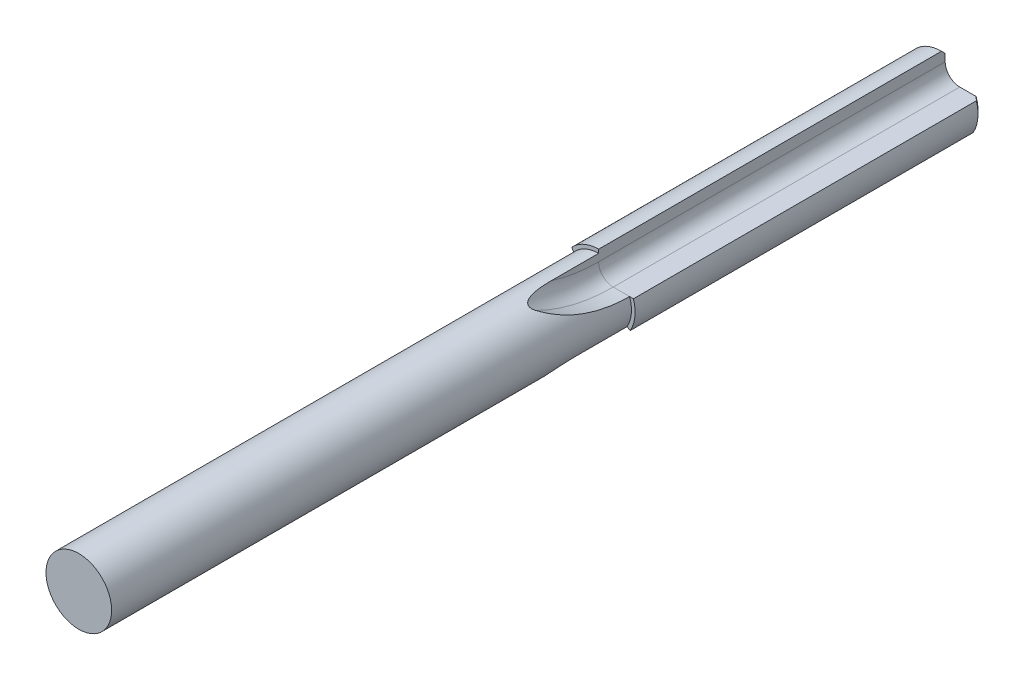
from build123d import *

# Parameters (mm, degrees)
REP_COUNT = 3


with BuildPart() as part:
    # EsqCorps → CorpsOutil (revolve)
    with BuildSketch(Plane(origin=(0, 0, 0), x_dir=(0, 0, -1), z_dir=(1, 0, 0)), mode=Mode.PRIVATE) as corpsoutil_sk:
        Polygon((0, 0), (-11.875, 0), (-11.875, 0.45), (-4.75, 0.45), (-4.75, 0.5), (-0.05, 0.5), (0, 0.45), align=None)
    revolve(corpsoutil_sk.sketch.rotate(Axis((0, 0, 11.663580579), (0, 0, -1)), 180), axis=Axis((0, 0, 11.663580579), (0, 0, -1)))

    # ALRD: sweep along a curve in space
    with BuildLine() as alrd_path:
        Line((0, 0, 0), (0, 0, 4.75))
        ThreePointArc((0, 2.5, 7.25), (0, 0.732233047, 6.517766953), (0, 0, 4.75))
        Line((0, 2.5, 7.25), (0, 2.6, 7.25))
    # Esq → ALRD (sweep, cut)
    with BuildSketch(Plane(origin=(0, 0, 0), x_dir=(-1, 0, 0), z_dir=(0, 0, -1))):
        with BuildLine():
            Line((0, 2.4), (0, 0.35))
            ThreePointArc((0, 0.35), (-0.058578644, 0.208578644), (-0.2, 0.15))
            Line((-0.2, 0.15), (-2.395307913, 0.15))
            ThreePointArc((-2.395307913, 0.15), (-1.643167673, 1.749285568), (0, 2.4))
        make_face()
    alrd = sweep(path=alrd_path.line, mode=Mode.SUBTRACT)

    # Rep: ALRD ×3 about axis
    rep_axis = Axis((0, 0, 0), (0, 0, 1))
    for i in range(1, REP_COUNT):
        add(alrd.rotate(rep_axis, i * 360 / REP_COUNT), mode=Mode.SUBTRACT)


solid = part.part
